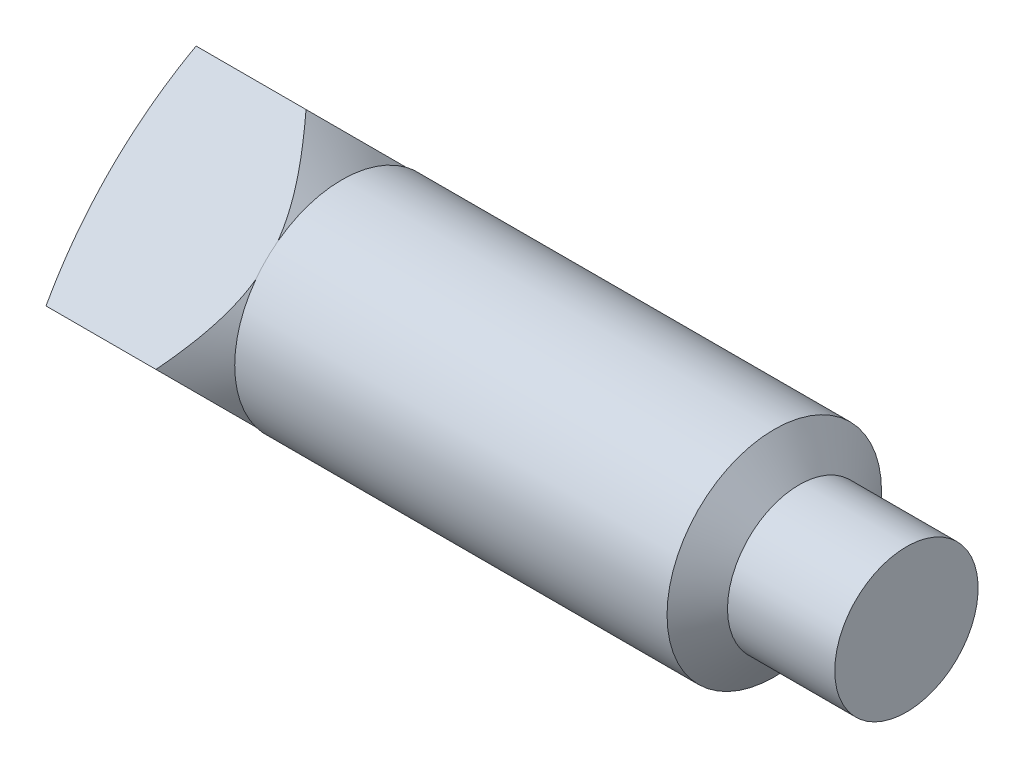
ISO-10303-21;
HEADER;
FILE_DESCRIPTION(('STEP AP214'),'2;1');
FILE_NAME('part.step','',(''),(''),'','','');
FILE_SCHEMA(('AUTOMOTIVE_DESIGN { 1 0 10303 214 1 1 1 1 }'));
ENDSEC;
DATA;
#1=APPLICATION_CONTEXT('core data for automotive mechanical design processes');
#2=APPLICATION_PROTOCOL_DEFINITION('international standard','automotive_design',2000,#1);
#3=PRODUCT_CONTEXT('',#1,'mechanical');
#4=PRODUCT('Part','Part','',(#3));
#5=PRODUCT_RELATED_PRODUCT_CATEGORY('part','',(#4));
#6=PRODUCT_DEFINITION_FORMATION('','',#4);
#7=PRODUCT_DEFINITION_CONTEXT('part definition',#1,'design');
#8=PRODUCT_DEFINITION('design','',#6,#7);
#9=PRODUCT_DEFINITION_SHAPE('','',#8);
#10=(LENGTH_UNIT() NAMED_UNIT(*) SI_UNIT(.MILLI.,.METRE.));
#11=(NAMED_UNIT(*) PLANE_ANGLE_UNIT() SI_UNIT($,.RADIAN.));
#12=(NAMED_UNIT(*) SI_UNIT($,.STERADIAN.) SOLID_ANGLE_UNIT());
#13=UNCERTAINTY_MEASURE_WITH_UNIT(LENGTH_MEASURE(1.E-05),#10,'distance_accuracy_value','');
#14=(GEOMETRIC_REPRESENTATION_CONTEXT(3) GLOBAL_UNCERTAINTY_ASSIGNED_CONTEXT((#13)) GLOBAL_UNIT_ASSIGNED_CONTEXT((#10,
#11,#12)) REPRESENTATION_CONTEXT('',''));
#15=CARTESIAN_POINT('',(0.,0.,0.));
#16=DIRECTION('',(0.,0.,1.));
#17=DIRECTION('',(1.,0.,0.));
#18=AXIS2_PLACEMENT_3D('',#15,#16,#17);
#19=CARTESIAN_POINT('',(-3.7592,0.,-3.376576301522));
#20=DIRECTION('',(0.,-0.707106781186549,0.707106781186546));
#21=DIRECTION('',(0.,-0.707106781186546,-0.707106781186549));
#22=AXIS2_PLACEMENT_3D('',#19,#20,#21);
#23=PLANE('',#22);
#24=CARTESIAN_POINT('',(-3.71463670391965,-2.84404188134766,-6.22061818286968));
#25=CARTESIAN_POINT('',(-3.55613835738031,-2.7014684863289,-6.07804478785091));
#26=CARTESIAN_POINT('',(-3.3981461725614,-2.55860959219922,-5.93518589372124));
#27=CARTESIAN_POINT('',(-3.08363247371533,-2.27203984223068,-5.64861614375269));
#28=CARTESIAN_POINT('',(-2.92711125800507,-2.12832882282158,-5.50490512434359));
#29=CARTESIAN_POINT('',(-2.61537743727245,-1.83919610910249,-5.2157724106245));
#30=CARTESIAN_POINT('',(-2.46017361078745,-1.69376967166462,-5.07034597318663));
#31=CARTESIAN_POINT('',(-2.15261018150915,-1.40143979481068,-4.77801609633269));
#32=CARTESIAN_POINT('',(-2.00025026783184,-1.25453651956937,-4.63111282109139));
#33=CARTESIAN_POINT('',(-1.72970912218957,-0.988182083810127,-4.36475838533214));
#34=CARTESIAN_POINT('',(-1.6107818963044,-0.869111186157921,-4.24568748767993));
#35=CARTESIAN_POINT('',(-1.37665028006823,-0.629105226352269,-4.00568152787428));
#36=CARTESIAN_POINT('',(-1.2614467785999,-0.508169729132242,-3.88474603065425));
#37=CARTESIAN_POINT('',(-1.03648369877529,-0.263755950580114,-3.64033225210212));
#38=CARTESIAN_POINT('',(-0.92672420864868,-0.140277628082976,-3.51685392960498));
#39=CARTESIAN_POINT('',(-0.768411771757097,0.0475823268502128,-3.32899397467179));
#40=CARTESIAN_POINT('',(-0.716703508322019,0.110632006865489,-3.26594429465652));
#41=CARTESIAN_POINT('',(-0.615958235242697,0.237786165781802,-3.13879013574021));
#42=CARTESIAN_POINT('',(-0.566920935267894,0.301890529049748,-3.07468577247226));
#43=CARTESIAN_POINT('',(-0.470564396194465,0.433616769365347,-2.94295953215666));
#44=CARTESIAN_POINT('',(-0.423365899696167,0.501283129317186,-2.87529317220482));
#45=CARTESIAN_POINT('',(-0.333664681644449,0.638144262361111,-2.73843203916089));
#46=CARTESIAN_POINT('',(-0.291160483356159,0.707338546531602,-2.6692377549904));
#47=CARTESIAN_POINT('',(-0.21229503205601,0.847303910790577,-2.52927239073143));
#48=CARTESIAN_POINT('',(-0.175920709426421,0.918071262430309,-2.4585050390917));
#49=CARTESIAN_POINT('',(-0.110910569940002,1.06137320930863,-2.31520309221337));
#50=CARTESIAN_POINT('',(-0.0822720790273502,1.1339071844,-2.24266911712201));
#51=CARTESIAN_POINT('',(-0.0393755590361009,1.26582470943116,-2.11075159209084));
#52=CARTESIAN_POINT('',(-0.0233846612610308,1.3249242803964,-2.0516520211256));
#53=CARTESIAN_POINT('',(0.00161538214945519,1.44386018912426,-1.93271611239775));
#54=CARTESIAN_POINT('',(0.0106258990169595,1.50369637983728,-1.87287992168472));
#55=CARTESIAN_POINT('',(0.021092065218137,1.62355655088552,-1.75301975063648));
#56=CARTESIAN_POINT('',(0.0225662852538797,1.68357970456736,-1.69299659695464));
#57=CARTESIAN_POINT('',(0.0179155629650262,1.80348109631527,-1.57309520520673));
#58=CARTESIAN_POINT('',(0.0117896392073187,1.86335931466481,-1.51321698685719));
#59=CARTESIAN_POINT('',(-0.0100815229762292,1.99721927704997,-1.37935702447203));
#60=CARTESIAN_POINT('',(-0.0278264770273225,2.0710373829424,-1.3055389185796));
#61=CARTESIAN_POINT('',(-0.0730208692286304,2.21718932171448,-1.15938697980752));
#62=CARTESIAN_POINT('',(-0.100477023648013,2.28952209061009,-1.08705421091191));
#63=CARTESIAN_POINT('',(-0.147658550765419,2.39694211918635,-0.97963418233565));
#64=CARTESIAN_POINT('',(-0.164455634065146,2.43269379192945,-0.943882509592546));
#65=CARTESIAN_POINT('',(-0.199813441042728,2.50374093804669,-0.872835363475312));
#66=CARTESIAN_POINT('',(-0.218373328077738,2.5390366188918,-0.837539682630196));
#67=CARTESIAN_POINT('',(-0.257053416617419,2.60919264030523,-0.76738366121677));
#68=CARTESIAN_POINT('',(-0.277173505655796,2.64405301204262,-0.73252328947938));
#69=CARTESIAN_POINT('',(-0.318791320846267,2.71336326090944,-0.663213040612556));
#70=CARTESIAN_POINT('',(-0.340289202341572,2.74781309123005,-0.628763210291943));
#71=CARTESIAN_POINT('',(-0.403215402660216,2.84534321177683,-0.53123308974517));
#72=CARTESIAN_POINT('',(-0.446099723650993,2.90795472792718,-0.468621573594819));
#73=CARTESIAN_POINT('',(-0.535121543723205,3.0320152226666,-0.344561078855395));
#74=CARTESIAN_POINT('',(-0.581259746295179,3.09346394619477,-0.283112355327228));
#75=CARTESIAN_POINT('',(-0.723571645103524,3.27639274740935,-0.100183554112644));
#76=CARTESIAN_POINT('',(-0.823588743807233,3.39637526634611,0.0197989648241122));
#77=CARTESIAN_POINT('',(-1.03047356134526,3.63375592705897,0.257179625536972));
#78=CARTESIAN_POINT('',(-1.13735948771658,3.75114599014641,0.374569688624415));
#79=CARTESIAN_POINT('',(-1.35557896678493,3.9837660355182,0.607189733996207));
#80=CARTESIAN_POINT('',(-1.4669107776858,4.09899683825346,0.722420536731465));
#81=CARTESIAN_POINT('',(-1.69305612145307,4.3282350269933,0.951658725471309));
#82=CARTESIAN_POINT('',(-1.8078789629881,4.44223779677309,1.06566149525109));
#83=CARTESIAN_POINT('',(-2.03983717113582,4.66907271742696,1.29249641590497));
#84=CARTESIAN_POINT('',(-2.1569727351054,4.78190476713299,1.405328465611));
#85=CARTESIAN_POINT('',(-2.39279712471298,5.00650286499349,1.6299265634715));
#86=CARTESIAN_POINT('',(-2.51148349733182,5.11827020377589,1.7416939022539));
#87=CARTESIAN_POINT('',(-2.75017246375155,5.34109999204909,1.9645236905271));
#88=CARTESIAN_POINT('',(-2.87017506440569,5.45216243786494,2.07558613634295));
#89=CARTESIAN_POINT('',(-3.05068333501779,5.61808795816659,2.2415116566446));
#90=CARTESIAN_POINT('',(-3.11080136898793,5.67316227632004,2.29658597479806));
#91=CARTESIAN_POINT('',(-3.23127854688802,5.78319708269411,2.40662078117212));
#92=CARTESIAN_POINT('',(-3.29163773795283,5.83815754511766,2.46158124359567));
#93=CARTESIAN_POINT('',(-3.41233885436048,5.94776482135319,2.5711885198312));
#94=CARTESIAN_POINT('',(-3.47268003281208,6.00241204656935,2.62583574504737));
#95=CARTESIAN_POINT('',(-3.59353260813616,6.11159399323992,2.73501769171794));
#96=CARTESIAN_POINT('',(-3.65404396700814,6.16612873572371,2.78955243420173));
#97=CARTESIAN_POINT('',(-3.71463670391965,6.22061818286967,2.84404188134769));
#98=B_SPLINE_CURVE_WITH_KNOTS('',3,(#24,#25,#26,#27,#28,#29,#30,#31,#32,#33,#34,#35,#36,#37,#38,
#39,#40,#41,#42,#43,#44,#45,#46,#47,#48,#49,#50,#51,#52,#53,#54,#55,#56,#57,#58,#59,#60,#61,#62,
#63,#64,#65,#66,#67,#68,#69,#70,#71,#72,#73,#74,#75,#76,#77,#78,#79,#80,#81,#82,#83,#84,#85,#86,
#87,#88,#89,#90,#91,#92,#93,#94,#95,#96,#97),.UNSPECIFIED.,.F.,.F.,(4,2,2,2,2,2,2,2,2,2,2,2,2,2,
2,2,2,2,2,2,2,2,2,2,2,2,2,2,2,2,2,2,2,2,2,2,4),(0.,0.769411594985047,1.53897600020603,
2.31192373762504,3.08478647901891,3.70321119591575,4.32178246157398,4.94036374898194,
5.24955145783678,5.55870549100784,5.87871228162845,6.19861811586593,6.51783299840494,
6.83693739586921,7.0919662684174,7.3469450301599,7.60129517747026,7.8556781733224,
8.17279662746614,8.49013483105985,8.64994152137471,8.80967274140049,8.96939245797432,
9.12913021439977,9.42418817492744,9.71931012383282,10.3099299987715,10.9021857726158,
11.4942117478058,12.0879855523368,12.6818102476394,13.2747881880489,13.8677692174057,
14.1629380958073,14.4581678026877,14.7523159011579,15.0464028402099),.UNSPECIFIED.);
#99=CARTESIAN_POINT('',(-0.808536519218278,0.,-3.376576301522));
#100=VERTEX_POINT('',#99);
#101=CARTESIAN_POINT('',(0.,1.44137193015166,-1.93520437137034));
#102=VERTEX_POINT('',#101);
#103=EDGE_CURVE('E159',#100,#102,#98,.T.);
#104=ORIENTED_EDGE('',*,*,#103,.F.);
#105=DIRECTION('',(1.,0.,0.));
#106=VECTOR('',#105,1.);
#107=CARTESIAN_POINT('',(-3.7592,0.,-3.376576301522));
#108=LINE('',#107,#106);
#109=CARTESIAN_POINT('',(-3.2823012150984,0.,-3.376576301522));
#110=VERTEX_POINT('',#109);
#111=EDGE_CURVE('E140',#110,#100,#108,.T.);
#112=ORIENTED_EDGE('',*,*,#111,.F.);
#113=CARTESIAN_POINT('',(8.4328,1.688288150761,-1.688288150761));
#114=DIRECTION('',(0.,-0.707106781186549,0.707106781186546));
#115=DIRECTION('',(0.,-0.707106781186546,-0.707106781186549));
#116=AXIS2_PLACEMENT_3D('',#113,#114,#115);
#117=CIRCLE('',#116,11.9559286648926);
#118=CARTESIAN_POINT('',(-3.2823012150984,3.376576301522,0.));
#119=VERTEX_POINT('',#118);
#120=EDGE_CURVE('E149',#119,#110,#117,.T.);
#121=ORIENTED_EDGE('',*,*,#120,.F.);
#122=DIRECTION('',(1.,0.,0.));
#123=VECTOR('',#122,1.);
#124=CARTESIAN_POINT('',(-3.7592,3.376576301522,0.));
#125=LINE('',#124,#123);
#126=CARTESIAN_POINT('',(-0.808536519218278,3.376576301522,0.));
#127=VERTEX_POINT('',#126);
#128=EDGE_CURVE('E147',#119,#127,#125,.T.);
#129=ORIENTED_EDGE('',*,*,#128,.T.);
#130=CARTESIAN_POINT('',(0.,1.93520437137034,-1.44137193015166));
#131=VERTEX_POINT('',#130);
#132=EDGE_CURVE('E169',#131,#127,#98,.T.);
#133=ORIENTED_EDGE('',*,*,#132,.F.);
#134=DIRECTION('',(0.,-0.707106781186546,-0.707106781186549));
#135=VECTOR('',#134,1.);
#136=CARTESIAN_POINT('',(0.,0.,-3.376576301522));
#137=LINE('',#136,#135);
#138=EDGE_CURVE('E40',#131,#102,#137,.T.);
#139=ORIENTED_EDGE('',*,*,#138,.T.);
#140=EDGE_LOOP('',(#104,#112,#121,#129,#133,#139));
#141=FACE_BOUND('',#140,.T.);
#142=ADVANCED_FACE('F32',(#141),#23,.F.);
#143=CARTESIAN_POINT('',(-3.7592,0.,-3.376576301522));
#144=DIRECTION('',(0.,0.707106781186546,0.707106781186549));
#145=DIRECTION('',(0.,-0.707106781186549,0.707106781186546));
#146=AXIS2_PLACEMENT_3D('',#143,#144,#145);
#147=PLANE('',#146);
#148=CARTESIAN_POINT('',(-3.71463670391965,-6.22061818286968,2.84404188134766));
#149=CARTESIAN_POINT('',(-3.55613835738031,-6.07804478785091,2.7014684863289));
#150=CARTESIAN_POINT('',(-3.3981461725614,-5.93518589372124,2.55860959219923));
#151=CARTESIAN_POINT('',(-3.08363247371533,-5.64861614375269,2.27203984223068));
#152=CARTESIAN_POINT('',(-2.92711125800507,-5.50490512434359,2.12832882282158));
#153=CARTESIAN_POINT('',(-2.61537743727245,-5.2157724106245,1.83919610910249));
#154=CARTESIAN_POINT('',(-2.46017361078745,-5.07034597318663,1.69376967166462));
#155=CARTESIAN_POINT('',(-2.15261018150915,-4.77801609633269,1.40143979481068));
#156=CARTESIAN_POINT('',(-2.00025026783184,-4.63111282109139,1.25453651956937));
#157=CARTESIAN_POINT('',(-1.72970912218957,-4.36475838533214,0.988182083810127));
#158=CARTESIAN_POINT('',(-1.6107818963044,-4.24568748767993,0.869111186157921));
#159=CARTESIAN_POINT('',(-1.37665028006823,-4.00568152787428,0.629105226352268));
#160=CARTESIAN_POINT('',(-1.2614467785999,-3.88474603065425,0.508169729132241));
#161=CARTESIAN_POINT('',(-1.03648369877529,-3.64033225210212,0.263755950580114));
#162=CARTESIAN_POINT('',(-0.92672420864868,-3.51685392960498,0.140277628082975));
#163=CARTESIAN_POINT('',(-0.768411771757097,-3.32899397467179,-0.0475823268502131));
#164=CARTESIAN_POINT('',(-0.716703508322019,-3.26594429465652,-0.11063200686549));
#165=CARTESIAN_POINT('',(-0.615958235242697,-3.13879013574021,-0.237786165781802));
#166=CARTESIAN_POINT('',(-0.566920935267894,-3.07468577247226,-0.301890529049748));
#167=CARTESIAN_POINT('',(-0.470564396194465,-2.94295953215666,-0.433616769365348));
#168=CARTESIAN_POINT('',(-0.423365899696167,-2.87529317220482,-0.501283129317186));
#169=CARTESIAN_POINT('',(-0.333664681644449,-2.73843203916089,-0.638144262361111));
#170=CARTESIAN_POINT('',(-0.291160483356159,-2.6692377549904,-0.707338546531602));
#171=CARTESIAN_POINT('',(-0.21229503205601,-2.52927239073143,-0.847303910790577));
#172=CARTESIAN_POINT('',(-0.175920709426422,-2.4585050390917,-0.918071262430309));
#173=CARTESIAN_POINT('',(-0.110910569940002,-2.31520309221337,-1.06137320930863));
#174=CARTESIAN_POINT('',(-0.0822720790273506,-2.24266911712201,-1.1339071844));
#175=CARTESIAN_POINT('',(-0.0393755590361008,-2.11075159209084,-1.26582470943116));
#176=CARTESIAN_POINT('',(-0.0233846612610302,-2.0516520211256,-1.3249242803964));
#177=CARTESIAN_POINT('',(0.00161538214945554,-1.93271611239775,-1.44386018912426));
#178=CARTESIAN_POINT('',(0.0106258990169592,-1.87287992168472,-1.50369637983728));
#179=CARTESIAN_POINT('',(0.0210920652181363,-1.75301975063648,-1.62355655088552));
#180=CARTESIAN_POINT('',(0.0225662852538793,-1.69299659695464,-1.68357970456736));
#181=CARTESIAN_POINT('',(0.0179155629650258,-1.57309520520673,-1.80348109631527));
#182=CARTESIAN_POINT('',(0.0117896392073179,-1.51321698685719,-1.86335931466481));
#183=CARTESIAN_POINT('',(-0.01008152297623,-1.37935702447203,-1.99721927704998));
#184=CARTESIAN_POINT('',(-0.0278264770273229,-1.3055389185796,-2.0710373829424));
#185=CARTESIAN_POINT('',(-0.0730208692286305,-1.15938697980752,-2.21718932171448));
#186=CARTESIAN_POINT('',(-0.100477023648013,-1.08705421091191,-2.28952209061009));
#187=CARTESIAN_POINT('',(-0.14765855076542,-0.97963418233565,-2.39694211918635));
#188=CARTESIAN_POINT('',(-0.164455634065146,-0.943882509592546,-2.43269379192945));
#189=CARTESIAN_POINT('',(-0.199813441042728,-0.872835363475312,-2.50374093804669));
#190=CARTESIAN_POINT('',(-0.218373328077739,-0.837539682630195,-2.5390366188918));
#191=CARTESIAN_POINT('',(-0.25705341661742,-0.767383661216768,-2.60919264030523));
#192=CARTESIAN_POINT('',(-0.277173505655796,-0.732523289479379,-2.64405301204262));
#193=CARTESIAN_POINT('',(-0.318791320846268,-0.663213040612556,-2.71336326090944));
#194=CARTESIAN_POINT('',(-0.340289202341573,-0.628763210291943,-2.74781309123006));
#195=CARTESIAN_POINT('',(-0.403215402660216,-0.53123308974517,-2.84534321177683));
#196=CARTESIAN_POINT('',(-0.446099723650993,-0.46862157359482,-2.90795472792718));
#197=CARTESIAN_POINT('',(-0.535121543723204,-0.344561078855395,-3.0320152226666));
#198=CARTESIAN_POINT('',(-0.581259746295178,-0.283112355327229,-3.09346394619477));
#199=CARTESIAN_POINT('',(-0.723571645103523,-0.100183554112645,-3.27639274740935));
#200=CARTESIAN_POINT('',(-0.823588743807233,0.0197989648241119,-3.39637526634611));
#201=CARTESIAN_POINT('',(-1.03047356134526,0.257179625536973,-3.63375592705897));
#202=CARTESIAN_POINT('',(-1.13735948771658,0.374569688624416,-3.75114599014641));
#203=CARTESIAN_POINT('',(-1.35557896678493,0.607189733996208,-3.9837660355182));
#204=CARTESIAN_POINT('',(-1.4669107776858,0.722420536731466,-4.09899683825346));
#205=CARTESIAN_POINT('',(-1.69305612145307,0.951658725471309,-4.3282350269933));
#206=CARTESIAN_POINT('',(-1.8078789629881,1.0656614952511,-4.44223779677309));
#207=CARTESIAN_POINT('',(-2.03983717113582,1.29249641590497,-4.66907271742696));
#208=CARTESIAN_POINT('',(-2.1569727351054,1.405328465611,-4.78190476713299));
#209=CARTESIAN_POINT('',(-2.39279712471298,1.6299265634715,-5.00650286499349));
#210=CARTESIAN_POINT('',(-2.51148349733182,1.7416939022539,-5.11827020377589));
#211=CARTESIAN_POINT('',(-2.75017246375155,1.9645236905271,-5.34109999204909));
#212=CARTESIAN_POINT('',(-2.87017506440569,2.07558613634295,-5.45216243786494));
#213=CARTESIAN_POINT('',(-3.05068333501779,2.2415116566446,-5.61808795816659));
#214=CARTESIAN_POINT('',(-3.11080136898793,2.29658597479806,-5.67316227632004));
#215=CARTESIAN_POINT('',(-3.23127854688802,2.40662078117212,-5.78319708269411));
#216=CARTESIAN_POINT('',(-3.29163773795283,2.46158124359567,-5.83815754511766));
#217=CARTESIAN_POINT('',(-3.41233885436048,2.5711885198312,-5.94776482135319));
#218=CARTESIAN_POINT('',(-3.47268003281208,2.62583574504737,-6.00241204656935));
#219=CARTESIAN_POINT('',(-3.59353260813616,2.73501769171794,-6.11159399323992));
#220=CARTESIAN_POINT('',(-3.65404396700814,2.78955243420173,-6.16612873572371));
#221=CARTESIAN_POINT('',(-3.71463670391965,2.84404188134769,-6.22061818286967));
#222=B_SPLINE_CURVE_WITH_KNOTS('',3,(#148,#149,#150,#151,#152,#153,#154,#155,#156,#157,#158,
#159,#160,#161,#162,#163,#164,#165,#166,#167,#168,#169,#170,#171,#172,#173,#174,#175,#176,#177,
#178,#179,#180,#181,#182,#183,#184,#185,#186,#187,#188,#189,#190,#191,#192,#193,#194,#195,#196,
#197,#198,#199,#200,#201,#202,#203,#204,#205,#206,#207,#208,#209,#210,#211,#212,#213,#214,#215,
#216,#217,#218,#219,#220,#221),.UNSPECIFIED.,.F.,.F.,(4,2,2,2,2,2,2,2,2,2,2,2,2,2,2,2,2,2,2,2,2,
2,2,2,2,2,2,2,2,2,2,2,2,2,2,2,4),(0.,0.769411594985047,1.53897600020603,2.31192373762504,
3.08478647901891,3.70321119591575,4.32178246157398,4.94036374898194,5.24955145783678,
5.55870549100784,5.87871228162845,6.19861811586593,6.51783299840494,6.83693739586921,
7.0919662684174,7.3469450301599,7.60129517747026,7.8556781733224,8.17279662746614,
8.49013483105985,8.64994152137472,8.80967274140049,8.96939245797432,9.12913021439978,
9.42418817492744,9.71931012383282,10.3099299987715,10.9021857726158,11.4942117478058,
12.0879855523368,12.6818102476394,13.2747881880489,13.8677692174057,14.1629380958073,
14.4581678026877,14.7523159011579,15.0464028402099),.UNSPECIFIED.);
#223=CARTESIAN_POINT('',(-0.808536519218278,-3.376576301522,0.));
#224=VERTEX_POINT('',#223);
#225=CARTESIAN_POINT('',(0.,-1.93520437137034,-1.44137193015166));
#226=VERTEX_POINT('',#225);
#227=EDGE_CURVE('E160',#224,#226,#222,.T.);
#228=ORIENTED_EDGE('',*,*,#227,.F.);
#229=DIRECTION('',(1.,0.,0.));
#230=VECTOR('',#229,1.);
#231=CARTESIAN_POINT('',(-3.7592,-3.376576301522,0.));
#232=LINE('',#231,#230);
#233=CARTESIAN_POINT('',(-3.2823012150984,-3.376576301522,0.));
#234=VERTEX_POINT('',#233);
#235=EDGE_CURVE('E143',#234,#224,#232,.T.);
#236=ORIENTED_EDGE('',*,*,#235,.F.);
#237=CARTESIAN_POINT('',(8.4328,-1.688288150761,-1.688288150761));
#238=DIRECTION('',(0.,0.707106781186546,0.707106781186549));
#239=DIRECTION('',(0.,-0.707106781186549,0.707106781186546));
#240=AXIS2_PLACEMENT_3D('',#237,#238,#239);
#241=CIRCLE('',#240,11.9559286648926);
#242=EDGE_CURVE('E156',#110,#234,#241,.T.);
#243=ORIENTED_EDGE('',*,*,#242,.F.);
#244=ORIENTED_EDGE('',*,*,#111,.T.);
#245=CARTESIAN_POINT('',(0.,-1.44137193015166,-1.93520437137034));
#246=VERTEX_POINT('',#245);
#247=EDGE_CURVE('E167',#246,#100,#222,.T.);
#248=ORIENTED_EDGE('',*,*,#247,.F.);
#249=DIRECTION('',(0.,-0.707106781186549,0.707106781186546));
#250=VECTOR('',#249,1.);
#251=CARTESIAN_POINT('',(0.,0.,-3.376576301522));
#252=LINE('',#251,#250);
#253=EDGE_CURVE('E127',#246,#226,#252,.T.);
#254=ORIENTED_EDGE('',*,*,#253,.T.);
#255=EDGE_LOOP('',(#228,#236,#243,#244,#248,#254));
#256=FACE_BOUND('',#255,.T.);
#257=ADVANCED_FACE('F175',(#256),#147,.F.);
#258=CARTESIAN_POINT('',(-3.7592,-3.376576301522,0.));
#259=DIRECTION('',(0.,0.707106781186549,-0.707106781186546));
#260=DIRECTION('',(0.,0.707106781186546,0.707106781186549));
#261=AXIS2_PLACEMENT_3D('',#258,#259,#260);
#262=PLANE('',#261);
#263=CARTESIAN_POINT('',(-3.71463670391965,2.84404188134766,6.22061818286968));
#264=CARTESIAN_POINT('',(-3.55613835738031,2.70146848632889,6.07804478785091));
#265=CARTESIAN_POINT('',(-3.3981461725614,2.55860959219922,5.93518589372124));
#266=CARTESIAN_POINT('',(-3.08363247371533,2.27203984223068,5.64861614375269));
#267=CARTESIAN_POINT('',(-2.92711125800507,2.12832882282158,5.50490512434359));
#268=CARTESIAN_POINT('',(-2.61537743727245,1.83919610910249,5.2157724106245));
#269=CARTESIAN_POINT('',(-2.46017361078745,1.69376967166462,5.07034597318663));
#270=CARTESIAN_POINT('',(-2.15261018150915,1.40143979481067,4.77801609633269));
#271=CARTESIAN_POINT('',(-2.00025026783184,1.25453651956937,4.63111282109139));
#272=CARTESIAN_POINT('',(-1.72970912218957,0.988182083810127,4.36475838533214));
#273=CARTESIAN_POINT('',(-1.6107818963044,0.869111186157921,4.24568748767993));
#274=CARTESIAN_POINT('',(-1.37665028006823,0.629105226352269,4.00568152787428));
#275=CARTESIAN_POINT('',(-1.2614467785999,0.508169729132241,3.88474603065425));
#276=CARTESIAN_POINT('',(-1.03648369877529,0.263755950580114,3.64033225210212));
#277=CARTESIAN_POINT('',(-0.926724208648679,0.140277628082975,3.51685392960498));
#278=CARTESIAN_POINT('',(-0.768411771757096,-0.0475823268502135,3.32899397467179));
#279=CARTESIAN_POINT('',(-0.716703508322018,-0.11063200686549,3.26594429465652));
#280=CARTESIAN_POINT('',(-0.615958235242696,-0.237786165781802,3.1387901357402));
#281=CARTESIAN_POINT('',(-0.566920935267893,-0.301890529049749,3.07468577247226));
#282=CARTESIAN_POINT('',(-0.470564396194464,-0.433616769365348,2.94295953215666));
#283=CARTESIAN_POINT('',(-0.423365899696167,-0.501283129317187,2.87529317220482));
#284=CARTESIAN_POINT('',(-0.333664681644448,-0.638144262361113,2.73843203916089));
#285=CARTESIAN_POINT('',(-0.291160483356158,-0.707338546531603,2.6692377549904));
#286=CARTESIAN_POINT('',(-0.212295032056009,-0.847303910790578,2.52927239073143));
#287=CARTESIAN_POINT('',(-0.175920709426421,-0.91807126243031,2.4585050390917));
#288=CARTESIAN_POINT('',(-0.110910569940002,-1.06137320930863,2.31520309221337));
#289=CARTESIAN_POINT('',(-0.0822720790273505,-1.1339071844,2.24266911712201));
#290=CARTESIAN_POINT('',(-0.0393755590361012,-1.26582470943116,2.11075159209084));
#291=CARTESIAN_POINT('',(-0.0233846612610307,-1.3249242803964,2.0516520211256));
#292=CARTESIAN_POINT('',(0.00161538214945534,-1.44386018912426,1.93271611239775));
#293=CARTESIAN_POINT('',(0.0106258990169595,-1.50369637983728,1.87287992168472));
#294=CARTESIAN_POINT('',(0.0210920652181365,-1.62355655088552,1.75301975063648));
#295=CARTESIAN_POINT('',(0.0225662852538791,-1.68357970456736,1.69299659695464));
#296=CARTESIAN_POINT('',(0.0179155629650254,-1.80348109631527,1.57309520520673));
#297=CARTESIAN_POINT('',(0.0117896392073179,-1.86335931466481,1.51321698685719));
#298=CARTESIAN_POINT('',(-0.0100815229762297,-1.99721927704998,1.37935702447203));
#299=CARTESIAN_POINT('',(-0.0278264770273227,-2.0710373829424,1.3055389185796));
#300=CARTESIAN_POINT('',(-0.0730208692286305,-2.21718932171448,1.15938697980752));
#301=CARTESIAN_POINT('',(-0.100477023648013,-2.28952209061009,1.08705421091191));
#302=CARTESIAN_POINT('',(-0.14765855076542,-2.39694211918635,0.979634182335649));
#303=CARTESIAN_POINT('',(-0.164455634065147,-2.43269379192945,0.943882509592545));
#304=CARTESIAN_POINT('',(-0.199813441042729,-2.50374093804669,0.872835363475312));
#305=CARTESIAN_POINT('',(-0.218373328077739,-2.5390366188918,0.837539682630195));
#306=CARTESIAN_POINT('',(-0.257053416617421,-2.60919264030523,0.767383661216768));
#307=CARTESIAN_POINT('',(-0.277173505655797,-2.64405301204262,0.732523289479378));
#308=CARTESIAN_POINT('',(-0.318791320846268,-2.71336326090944,0.663213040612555));
#309=CARTESIAN_POINT('',(-0.340289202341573,-2.74781309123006,0.628763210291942));
#310=CARTESIAN_POINT('',(-0.403215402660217,-2.84534321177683,0.531233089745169));
#311=CARTESIAN_POINT('',(-0.446099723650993,-2.90795472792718,0.468621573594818));
#312=CARTESIAN_POINT('',(-0.535121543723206,-3.0320152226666,0.344561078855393));
#313=CARTESIAN_POINT('',(-0.58125974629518,-3.09346394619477,0.283112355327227));
#314=CARTESIAN_POINT('',(-0.723571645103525,-3.27639274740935,0.100183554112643));
#315=CARTESIAN_POINT('',(-0.823588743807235,-3.39637526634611,-0.019798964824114));
#316=CARTESIAN_POINT('',(-1.03047356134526,-3.63375592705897,-0.257179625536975));
#317=CARTESIAN_POINT('',(-1.13735948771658,-3.75114599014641,-0.374569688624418));
#318=CARTESIAN_POINT('',(-1.35557896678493,-3.98376603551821,-0.607189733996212));
#319=CARTESIAN_POINT('',(-1.4669107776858,-4.09899683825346,-0.72242053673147));
#320=CARTESIAN_POINT('',(-1.69305612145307,-4.32823502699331,-0.951658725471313));
#321=CARTESIAN_POINT('',(-1.80787896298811,-4.44223779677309,-1.0656614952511));
#322=CARTESIAN_POINT('',(-2.03983717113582,-4.66907271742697,-1.29249641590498));
#323=CARTESIAN_POINT('',(-2.1569727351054,-4.78190476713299,-1.405328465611));
#324=CARTESIAN_POINT('',(-2.39279712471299,-5.0065028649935,-1.62992656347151));
#325=CARTESIAN_POINT('',(-2.51148349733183,-5.11827020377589,-1.74169390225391));
#326=CARTESIAN_POINT('',(-2.75017246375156,-5.3410999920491,-1.96452369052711));
#327=CARTESIAN_POINT('',(-2.8701750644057,-5.45216243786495,-2.07558613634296));
#328=CARTESIAN_POINT('',(-3.05068333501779,-5.6180879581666,-2.24151165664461));
#329=CARTESIAN_POINT('',(-3.11080136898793,-5.67316227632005,-2.29658597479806));
#330=CARTESIAN_POINT('',(-3.23127854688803,-5.78319708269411,-2.40662078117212));
#331=CARTESIAN_POINT('',(-3.29163773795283,-5.83815754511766,-2.46158124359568));
#332=CARTESIAN_POINT('',(-3.41233885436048,-5.94776482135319,-2.57118851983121));
#333=CARTESIAN_POINT('',(-3.47268003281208,-6.00241204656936,-2.62583574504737));
#334=CARTESIAN_POINT('',(-3.59353260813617,-6.11159399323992,-2.73501769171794));
#335=CARTESIAN_POINT('',(-3.65404396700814,-6.16612873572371,-2.78955243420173));
#336=CARTESIAN_POINT('',(-3.71463670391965,-6.22061818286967,-2.84404188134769));
#337=B_SPLINE_CURVE_WITH_KNOTS('',3,(#263,#264,#265,#266,#267,#268,#269,#270,#271,#272,#273,
#274,#275,#276,#277,#278,#279,#280,#281,#282,#283,#284,#285,#286,#287,#288,#289,#290,#291,#292,
#293,#294,#295,#296,#297,#298,#299,#300,#301,#302,#303,#304,#305,#306,#307,#308,#309,#310,#311,
#312,#313,#314,#315,#316,#317,#318,#319,#320,#321,#322,#323,#324,#325,#326,#327,#328,#329,#330,
#331,#332,#333,#334,#335,#336),.UNSPECIFIED.,.F.,.F.,(4,2,2,2,2,2,2,2,2,2,2,2,2,2,2,2,2,2,2,2,2,
2,2,2,2,2,2,2,2,2,2,2,2,2,2,2,4),(0.,0.769411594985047,1.53897600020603,2.31192373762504,
3.08478647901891,3.70321119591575,4.32178246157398,4.94036374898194,5.24955145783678,
5.55870549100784,5.87871228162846,6.19861811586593,6.51783299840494,6.83693739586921,
7.0919662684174,7.34694503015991,7.60129517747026,7.8556781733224,8.17279662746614,
8.49013483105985,8.64994152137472,8.80967274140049,8.96939245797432,9.12913021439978,
9.42418817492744,9.71931012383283,10.3099299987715,10.9021857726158,11.4942117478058,
12.0879855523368,12.6818102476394,13.2747881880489,13.8677692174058,14.1629380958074,
14.4581678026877,14.7523159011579,15.0464028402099),.UNSPECIFIED.);
#338=CARTESIAN_POINT('',(-0.808536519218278,0.,3.376576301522));
#339=VERTEX_POINT('',#338);
#340=CARTESIAN_POINT('',(0.,-1.44137193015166,1.93520437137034));
#341=VERTEX_POINT('',#340);
#342=EDGE_CURVE('E54',#339,#341,#337,.T.);
#343=ORIENTED_EDGE('',*,*,#342,.F.);
#344=DIRECTION('',(1.,0.,0.));
#345=VECTOR('',#344,1.);
#346=CARTESIAN_POINT('',(-3.7592,0.,3.376576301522));
#347=LINE('',#346,#345);
#348=CARTESIAN_POINT('',(-3.2823012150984,0.,3.376576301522));
#349=VERTEX_POINT('',#348);
#350=EDGE_CURVE('E115',#349,#339,#347,.T.);
#351=ORIENTED_EDGE('',*,*,#350,.F.);
#352=CARTESIAN_POINT('',(8.4328,-1.688288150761,1.688288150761));
#353=DIRECTION('',(0.,0.707106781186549,-0.707106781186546));
#354=DIRECTION('',(0.,0.707106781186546,0.707106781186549));
#355=AXIS2_PLACEMENT_3D('',#352,#353,#354);
#356=CIRCLE('',#355,11.9559286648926);
#357=EDGE_CURVE('E46',#234,#349,#356,.T.);
#358=ORIENTED_EDGE('',*,*,#357,.F.);
#359=ORIENTED_EDGE('',*,*,#235,.T.);
#360=CARTESIAN_POINT('',(0.,-1.93520437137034,1.44137193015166));
#361=VERTEX_POINT('',#360);
#362=EDGE_CURVE('E168',#361,#224,#337,.T.);
#363=ORIENTED_EDGE('',*,*,#362,.F.);
#364=DIRECTION('',(0.,0.707106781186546,0.707106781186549));
#365=VECTOR('',#364,1.);
#366=CARTESIAN_POINT('',(0.,-3.376576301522,0.));
#367=LINE('',#366,#365);
#368=EDGE_CURVE('E121',#361,#341,#367,.T.);
#369=ORIENTED_EDGE('',*,*,#368,.T.);
#370=EDGE_LOOP('',(#343,#351,#358,#359,#363,#369));
#371=FACE_BOUND('',#370,.T.);
#372=ADVANCED_FACE('F196',(#371),#262,.F.);
#373=CARTESIAN_POINT('',(-3.7592,3.376576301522,0.));
#374=DIRECTION('',(0.,-0.707106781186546,-0.707106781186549));
#375=DIRECTION('',(0.,0.707106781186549,-0.707106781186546));
#376=AXIS2_PLACEMENT_3D('',#373,#374,#375);
#377=PLANE('',#376);
#378=CARTESIAN_POINT('',(-3.71463670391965,6.22061818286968,-2.84404188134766));
#379=CARTESIAN_POINT('',(-3.55613835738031,6.07804478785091,-2.70146848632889));
#380=CARTESIAN_POINT('',(-3.3981461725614,5.93518589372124,-2.55860959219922));
#381=CARTESIAN_POINT('',(-3.08363247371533,5.64861614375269,-2.27203984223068));
#382=CARTESIAN_POINT('',(-2.92711125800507,5.50490512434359,-2.12832882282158));
#383=CARTESIAN_POINT('',(-2.61537743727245,5.2157724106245,-1.83919610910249));
#384=CARTESIAN_POINT('',(-2.46017361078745,5.07034597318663,-1.69376967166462));
#385=CARTESIAN_POINT('',(-2.15261018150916,4.77801609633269,-1.40143979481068));
#386=CARTESIAN_POINT('',(-2.00025026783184,4.63111282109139,-1.25453651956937));
#387=CARTESIAN_POINT('',(-1.72970912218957,4.36475838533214,-0.988182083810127));
#388=CARTESIAN_POINT('',(-1.6107818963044,4.24568748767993,-0.869111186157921));
#389=CARTESIAN_POINT('',(-1.37665028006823,4.00568152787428,-0.629105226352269));
#390=CARTESIAN_POINT('',(-1.2614467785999,3.88474603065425,-0.508169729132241));
#391=CARTESIAN_POINT('',(-1.03648369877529,3.64033225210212,-0.263755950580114));
#392=CARTESIAN_POINT('',(-0.926724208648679,3.51685392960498,-0.140277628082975));
#393=CARTESIAN_POINT('',(-0.768411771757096,3.32899397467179,0.0475823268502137));
#394=CARTESIAN_POINT('',(-0.716703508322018,3.26594429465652,0.110632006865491));
#395=CARTESIAN_POINT('',(-0.615958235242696,3.1387901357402,0.237786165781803));
#396=CARTESIAN_POINT('',(-0.566920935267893,3.07468577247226,0.301890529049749));
#397=CARTESIAN_POINT('',(-0.470564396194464,2.94295953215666,0.433616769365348));
#398=CARTESIAN_POINT('',(-0.423365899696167,2.87529317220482,0.501283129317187));
#399=CARTESIAN_POINT('',(-0.333664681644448,2.73843203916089,0.638144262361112));
#400=CARTESIAN_POINT('',(-0.291160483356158,2.6692377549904,0.707338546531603));
#401=CARTESIAN_POINT('',(-0.212295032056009,2.52927239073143,0.847303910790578));
#402=CARTESIAN_POINT('',(-0.175920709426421,2.45850503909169,0.91807126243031));
#403=CARTESIAN_POINT('',(-0.110910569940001,2.31520309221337,1.06137320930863));
#404=CARTESIAN_POINT('',(-0.0822720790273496,2.24266911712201,1.1339071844));
#405=CARTESIAN_POINT('',(-0.0393755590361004,2.11075159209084,1.26582470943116));
#406=CARTESIAN_POINT('',(-0.0233846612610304,2.0516520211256,1.3249242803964));
#407=CARTESIAN_POINT('',(0.00161538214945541,1.93271611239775,1.44386018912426));
#408=CARTESIAN_POINT('',(0.0106258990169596,1.87287992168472,1.50369637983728));
#409=CARTESIAN_POINT('',(0.0210920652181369,1.75301975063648,1.62355655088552));
#410=CARTESIAN_POINT('',(0.0225662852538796,1.69299659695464,1.68357970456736));
#411=CARTESIAN_POINT('',(0.0179155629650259,1.57309520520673,1.80348109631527));
#412=CARTESIAN_POINT('',(0.0117896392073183,1.51321698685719,1.86335931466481));
#413=CARTESIAN_POINT('',(-0.0100815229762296,1.37935702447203,1.99721927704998));
#414=CARTESIAN_POINT('',(-0.0278264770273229,1.3055389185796,2.0710373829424));
#415=CARTESIAN_POINT('',(-0.0730208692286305,1.15938697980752,2.21718932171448));
#416=CARTESIAN_POINT('',(-0.100477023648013,1.08705421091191,2.28952209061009));
#417=CARTESIAN_POINT('',(-0.14765855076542,0.979634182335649,2.39694211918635));
#418=CARTESIAN_POINT('',(-0.164455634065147,0.943882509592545,2.43269379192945));
#419=CARTESIAN_POINT('',(-0.199813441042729,0.872835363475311,2.50374093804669));
#420=CARTESIAN_POINT('',(-0.218373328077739,0.837539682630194,2.5390366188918));
#421=CARTESIAN_POINT('',(-0.25705341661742,0.767383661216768,2.60919264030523));
#422=CARTESIAN_POINT('',(-0.277173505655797,0.732523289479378,2.64405301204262));
#423=CARTESIAN_POINT('',(-0.318791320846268,0.663213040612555,2.71336326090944));
#424=CARTESIAN_POINT('',(-0.340289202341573,0.628763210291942,2.74781309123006));
#425=CARTESIAN_POINT('',(-0.403215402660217,0.531233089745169,2.84534321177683));
#426=CARTESIAN_POINT('',(-0.446099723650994,0.468621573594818,2.90795472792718));
#427=CARTESIAN_POINT('',(-0.535121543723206,0.344561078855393,3.0320152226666));
#428=CARTESIAN_POINT('',(-0.58125974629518,0.283112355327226,3.09346394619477));
#429=CARTESIAN_POINT('',(-0.723571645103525,0.100183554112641,3.27639274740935));
#430=CARTESIAN_POINT('',(-0.823588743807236,-0.0197989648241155,3.39637526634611));
#431=CARTESIAN_POINT('',(-1.03047356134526,-0.257179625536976,3.63375592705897));
#432=CARTESIAN_POINT('',(-1.13735948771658,-0.37456968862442,3.75114599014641));
#433=CARTESIAN_POINT('',(-1.35557896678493,-0.607189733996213,3.98376603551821));
#434=CARTESIAN_POINT('',(-1.4669107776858,-0.72242053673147,4.09899683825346));
#435=CARTESIAN_POINT('',(-1.69305612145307,-0.951658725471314,4.32823502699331));
#436=CARTESIAN_POINT('',(-1.80787896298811,-1.0656614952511,4.44223779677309));
#437=CARTESIAN_POINT('',(-2.03983717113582,-1.29249641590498,4.66907271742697));
#438=CARTESIAN_POINT('',(-2.1569727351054,-1.405328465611,4.78190476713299));
#439=CARTESIAN_POINT('',(-2.39279712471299,-1.62992656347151,5.0065028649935));
#440=CARTESIAN_POINT('',(-2.51148349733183,-1.74169390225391,5.1182702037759));
#441=CARTESIAN_POINT('',(-2.75017246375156,-1.96452369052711,5.3410999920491));
#442=CARTESIAN_POINT('',(-2.8701750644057,-2.07558613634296,5.45216243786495));
#443=CARTESIAN_POINT('',(-3.0506833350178,-2.24151165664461,5.6180879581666));
#444=CARTESIAN_POINT('',(-3.11080136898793,-2.29658597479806,5.67316227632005));
#445=CARTESIAN_POINT('',(-3.23127854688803,-2.40662078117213,5.78319708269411));
#446=CARTESIAN_POINT('',(-3.29163773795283,-2.46158124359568,5.83815754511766));
#447=CARTESIAN_POINT('',(-3.41233885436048,-2.57118851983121,5.94776482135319));
#448=CARTESIAN_POINT('',(-3.47268003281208,-2.62583574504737,6.00241204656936));
#449=CARTESIAN_POINT('',(-3.59353260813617,-2.73501769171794,6.11159399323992));
#450=CARTESIAN_POINT('',(-3.65404396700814,-2.78955243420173,6.16612873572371));
#451=CARTESIAN_POINT('',(-3.71463670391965,-2.84404188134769,6.22061818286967));
#452=B_SPLINE_CURVE_WITH_KNOTS('',3,(#378,#379,#380,#381,#382,#383,#384,#385,#386,#387,#388,
#389,#390,#391,#392,#393,#394,#395,#396,#397,#398,#399,#400,#401,#402,#403,#404,#405,#406,#407,
#408,#409,#410,#411,#412,#413,#414,#415,#416,#417,#418,#419,#420,#421,#422,#423,#424,#425,#426,
#427,#428,#429,#430,#431,#432,#433,#434,#435,#436,#437,#438,#439,#440,#441,#442,#443,#444,#445,
#446,#447,#448,#449,#450,#451),.UNSPECIFIED.,.F.,.F.,(4,2,2,2,2,2,2,2,2,2,2,2,2,2,2,2,2,2,2,2,2,
2,2,2,2,2,2,2,2,2,2,2,2,2,2,2,4),(0.,0.769411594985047,1.53897600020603,2.31192373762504,
3.08478647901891,3.70321119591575,4.32178246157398,4.94036374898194,5.24955145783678,
5.55870549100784,5.87871228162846,6.19861811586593,6.51783299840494,6.83693739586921,
7.0919662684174,7.34694503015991,7.60129517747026,7.8556781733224,8.17279662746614,
8.49013483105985,8.64994152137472,8.80967274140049,8.96939245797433,9.12913021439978,
9.42418817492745,9.71931012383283,10.3099299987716,10.9021857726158,11.4942117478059,
12.0879855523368,12.6818102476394,13.2747881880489,13.8677692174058,14.1629380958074,
14.4581678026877,14.752315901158,15.0464028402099),.UNSPECIFIED.);
#453=CARTESIAN_POINT('',(0.,1.93520437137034,1.44137193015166));
#454=VERTEX_POINT('',#453);
#455=EDGE_CURVE('E117',#127,#454,#452,.T.);
#456=ORIENTED_EDGE('',*,*,#455,.F.);
#457=ORIENTED_EDGE('',*,*,#128,.F.);
#458=CARTESIAN_POINT('',(8.4328,1.688288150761,1.688288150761));
#459=DIRECTION('',(0.,-0.707106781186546,-0.707106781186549));
#460=DIRECTION('',(0.,0.707106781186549,-0.707106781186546));
#461=AXIS2_PLACEMENT_3D('',#458,#459,#460);
#462=CIRCLE('',#461,11.9559286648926);
#463=EDGE_CURVE('E11',#349,#119,#462,.T.);
#464=ORIENTED_EDGE('',*,*,#463,.F.);
#465=ORIENTED_EDGE('',*,*,#350,.T.);
#466=CARTESIAN_POINT('',(0.,1.44137193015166,1.93520437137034));
#467=VERTEX_POINT('',#466);
#468=EDGE_CURVE('E99',#467,#339,#452,.T.);
#469=ORIENTED_EDGE('',*,*,#468,.F.);
#470=DIRECTION('',(0.,0.707106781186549,-0.707106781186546));
#471=VECTOR('',#470,1.);
#472=CARTESIAN_POINT('',(0.,3.376576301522,0.));
#473=LINE('',#472,#471);
#474=EDGE_CURVE('E113',#467,#454,#473,.T.);
#475=ORIENTED_EDGE('',*,*,#474,.T.);
#476=EDGE_LOOP('',(#456,#457,#464,#465,#469,#475));
#477=FACE_BOUND('',#476,.T.);
#478=ADVANCED_FACE('F112',(#477),#377,.F.);
#479=CARTESIAN_POINT('',(0.,0.,0.));
#480=DIRECTION('',(-1.,0.,0.));
#481=DIRECTION('',(0.,0.,1.));
#482=AXIS2_PLACEMENT_3D('',#479,#480,#481);
#483=PLANE('',#482);
#484=ORIENTED_EDGE('',*,*,#138,.F.);
#485=CARTESIAN_POINT('',(0.,0.,0.));
#486=DIRECTION('',(-1.,0.,0.));
#487=DIRECTION('',(0.,0.,1.));
#488=AXIS2_PLACEMENT_3D('',#485,#486,#487);
#489=CIRCLE('',#488,2.413);
#490=EDGE_CURVE('E130',#131,#102,#489,.T.);
#491=ORIENTED_EDGE('',*,*,#490,.T.);
#492=EDGE_LOOP('',(#484,#491));
#493=FACE_BOUND('',#492,.T.);
#494=ADVANCED_FACE('F202',(#493),#483,.T.);
#495=ORIENTED_EDGE('',*,*,#474,.F.);
#496=EDGE_CURVE('E106',#467,#454,#489,.T.);
#497=ORIENTED_EDGE('',*,*,#496,.T.);
#498=EDGE_LOOP('',(#495,#497));
#499=FACE_BOUND('',#498,.T.);
#500=ADVANCED_FACE('F120',(#499),#483,.T.);
#501=ORIENTED_EDGE('',*,*,#368,.F.);
#502=EDGE_CURVE('E104',#361,#341,#489,.T.);
#503=ORIENTED_EDGE('',*,*,#502,.T.);
#504=EDGE_LOOP('',(#501,#503));
#505=FACE_BOUND('',#504,.T.);
#506=ADVANCED_FACE('F232',(#505),#483,.T.);
#507=ORIENTED_EDGE('',*,*,#253,.F.);
#508=EDGE_CURVE('E245',#246,#226,#489,.T.);
#509=ORIENTED_EDGE('',*,*,#508,.T.);
#510=EDGE_LOOP('',(#507,#509));
#511=FACE_BOUND('',#510,.T.);
#512=ADVANCED_FACE('F34',(#511),#483,.T.);
#513=CARTESIAN_POINT('',(0.,0.,0.));
#514=DIRECTION('',(-1.,0.,0.));
#515=DIRECTION('',(0.,0.,1.));
#516=AXIS2_PLACEMENT_3D('',#513,#514,#515);
#517=CYLINDRICAL_SURFACE('',#516,2.413);
#518=CARTESIAN_POINT('',(9.72676394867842,0.,0.));
#519=DIRECTION('',(-1.,0.,0.));
#520=DIRECTION('',(0.,0.,1.));
#521=AXIS2_PLACEMENT_3D('',#518,#519,#520);
#522=CIRCLE('',#521,2.413);
#523=CARTESIAN_POINT('',(9.72676394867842,0.,2.413));
#524=VERTEX_POINT('',#523);
#525=EDGE_CURVE('E105',#524,#524,#522,.T.);
#526=ORIENTED_EDGE('',*,*,#525,.T.);
#527=EDGE_LOOP('',(#526));
#528=FACE_BOUND('',#527,.T.);
#529=ORIENTED_EDGE('',*,*,#496,.F.);
#530=EDGE_CURVE('E96',#341,#467,#489,.T.);
#531=ORIENTED_EDGE('',*,*,#530,.F.);
#532=ORIENTED_EDGE('',*,*,#502,.F.);
#533=EDGE_CURVE('E252',#226,#361,#489,.T.);
#534=ORIENTED_EDGE('',*,*,#533,.F.);
#535=ORIENTED_EDGE('',*,*,#508,.F.);
#536=EDGE_CURVE('E250',#102,#246,#489,.T.);
#537=ORIENTED_EDGE('',*,*,#536,.F.);
#538=ORIENTED_EDGE('',*,*,#490,.F.);
#539=EDGE_CURVE('E126',#454,#131,#489,.T.);
#540=ORIENTED_EDGE('',*,*,#539,.F.);
#541=EDGE_LOOP('',(#529,#531,#532,#534,#535,#537,#538,#540));
#542=FACE_BOUND('',#541,.T.);
#543=ADVANCED_FACE('F124',(#528,#542),#517,.T.);
#544=CARTESIAN_POINT('',(10.287,0.,0.));
#545=DIRECTION('',(-1.,0.,0.));
#546=DIRECTION('',(0.,0.,1.));
#547=AXIS2_PLACEMENT_3D('',#544,#545,#546);
#548=CONICAL_SURFACE('',#547,1.6129,0.959931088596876);
#549=ORIENTED_EDGE('',*,*,#525,.F.);
#550=EDGE_LOOP('',(#549));
#551=FACE_BOUND('',#550,.T.);
#552=CARTESIAN_POINT('',(10.287,0.,0.));
#553=DIRECTION('',(-1.,0.,0.));
#554=DIRECTION('',(0.,0.,1.));
#555=AXIS2_PLACEMENT_3D('',#552,#553,#554);
#556=CIRCLE('',#555,1.6129);
#557=CARTESIAN_POINT('',(10.287,0.,1.6129));
#558=VERTEX_POINT('',#557);
#559=EDGE_CURVE('E134',#558,#558,#556,.T.);
#560=ORIENTED_EDGE('',*,*,#559,.T.);
#561=EDGE_LOOP('',(#560));
#562=FACE_BOUND('',#561,.T.);
#563=ADVANCED_FACE('F223',(#551,#562),#548,.T.);
#564=CARTESIAN_POINT('',(0.,0.,0.));
#565=DIRECTION('',(-1.,0.,0.));
#566=DIRECTION('',(0.,0.,1.));
#567=AXIS2_PLACEMENT_3D('',#564,#565,#566);
#568=CYLINDRICAL_SURFACE('',#567,1.6129);
#569=CARTESIAN_POINT('',(12.7,0.,0.));
#570=DIRECTION('',(-1.,0.,0.));
#571=DIRECTION('',(0.,0.,1.));
#572=AXIS2_PLACEMENT_3D('',#569,#570,#571);
#573=CIRCLE('',#572,1.6129);
#574=CARTESIAN_POINT('',(12.7,0.,1.6129));
#575=VERTEX_POINT('',#574);
#576=EDGE_CURVE('E137',#575,#575,#573,.T.);
#577=ORIENTED_EDGE('',*,*,#576,.T.);
#578=EDGE_LOOP('',(#577));
#579=FACE_BOUND('',#578,.T.);
#580=ORIENTED_EDGE('',*,*,#559,.F.);
#581=EDGE_LOOP('',(#580));
#582=FACE_BOUND('',#581,.T.);
#583=ADVANCED_FACE('F219',(#579,#582),#568,.T.);
#584=CARTESIAN_POINT('',(12.7,1.6129,0.));
#585=DIRECTION('',(1.,0.,0.));
#586=DIRECTION('',(0.,0.,-1.));
#587=AXIS2_PLACEMENT_3D('',#584,#585,#586);
#588=PLANE('',#587);
#589=ORIENTED_EDGE('',*,*,#576,.F.);
#590=EDGE_LOOP('',(#589));
#591=FACE_BOUND('',#590,.T.);
#592=ADVANCED_FACE('F216',(#591),#588,.T.);
#593=CARTESIAN_POINT('',(8.4328,0.,0.));
#594=DIRECTION('',(-1.,0.,0.));
#595=DIRECTION('',(0.,1.,0.));
#596=AXIS2_PLACEMENT_3D('',#593,#594,#595);
#597=SPHERICAL_SURFACE('',#596,12.192);
#598=CARTESIAN_POINT('',(-3.7592,0.,0.));
#599=VERTEX_POINT('',#598);
#600=VERTEX_LOOP('',#599);
#601=FACE_BOUND('',#600,.T.);
#602=ORIENTED_EDGE('',*,*,#120,.T.);
#603=ORIENTED_EDGE('',*,*,#242,.T.);
#604=ORIENTED_EDGE('',*,*,#357,.T.);
#605=ORIENTED_EDGE('',*,*,#463,.T.);
#606=EDGE_LOOP('',(#602,#603,#604,#605));
#607=FACE_BOUND('',#606,.T.);
#608=ADVANCED_FACE('F185',(#601,#607),#597,.T.);
#609=CARTESIAN_POINT('',(-0.808536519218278,0.,0.));
#610=DIRECTION('',(-1.,0.,0.));
#611=DIRECTION('',(0.,0.,1.));
#612=AXIS2_PLACEMENT_3D('',#609,#610,#611);
#613=CONICAL_SURFACE('',#612,3.376576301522,0.872664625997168);
#614=ORIENTED_EDGE('',*,*,#342,.T.);
#615=ORIENTED_EDGE('',*,*,#530,.T.);
#616=ORIENTED_EDGE('',*,*,#468,.T.);
#617=EDGE_LOOP('',(#614,#615,#616));
#618=FACE_BOUND('',#617,.T.);
#619=ADVANCED_FACE('F98',(#618),#613,.T.);
#620=ORIENTED_EDGE('',*,*,#227,.T.);
#621=ORIENTED_EDGE('',*,*,#533,.T.);
#622=ORIENTED_EDGE('',*,*,#362,.T.);
#623=EDGE_LOOP('',(#620,#621,#622));
#624=FACE_BOUND('',#623,.T.);
#625=ADVANCED_FACE('F183',(#624),#613,.T.);
#626=ORIENTED_EDGE('',*,*,#103,.T.);
#627=ORIENTED_EDGE('',*,*,#536,.T.);
#628=ORIENTED_EDGE('',*,*,#247,.T.);
#629=EDGE_LOOP('',(#626,#627,#628));
#630=FACE_BOUND('',#629,.T.);
#631=ADVANCED_FACE('F178',(#630),#613,.T.);
#632=ORIENTED_EDGE('',*,*,#132,.T.);
#633=ORIENTED_EDGE('',*,*,#455,.T.);
#634=ORIENTED_EDGE('',*,*,#539,.T.);
#635=EDGE_LOOP('',(#632,#633,#634));
#636=FACE_BOUND('',#635,.T.);
#637=ADVANCED_FACE('F182',(#636),#613,.T.);
#638=CLOSED_SHELL('',(#142,#257,#372,#478,#494,#500,#506,#512,#543,#563,#583,#592,#608,#619,
#625,#631,#637));
#639=MANIFOLD_SOLID_BREP('B2',#638);
#640=ADVANCED_BREP_SHAPE_REPRESENTATION('',(#18,#639),#14);
#641=SHAPE_DEFINITION_REPRESENTATION(#9,#640);
ENDSEC;
END-ISO-10303-21;
